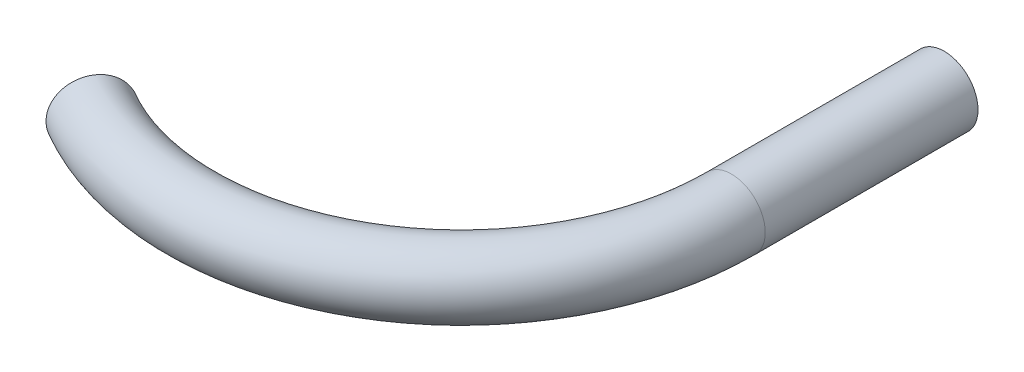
from build123d import *

# Parameters (mm, degrees)
SKETCH1_R           = 1.5875
SKETCH1_R_2         = 0.79375
REVOLVE1_ANGLE      = 120
SKETCH2_R           = 1.5875
SKETCH2_R_2         = 0.79375
BOSS_EXTRUDE1_DEPTH = 10


with BuildPart() as part:
    # Sketch1 → Revolve1 (revolve)
    with BuildSketch(Plane.XY):
        with Locations((12.7, 0)):
            Circle(SKETCH1_R)
        with Locations((12.7, 0)):
            Circle(SKETCH1_R_2, mode=Mode.SUBTRACT)
    revolve(axis=Axis((0, 67.148637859, 0), (0, -1, 0)), revolution_arc=REVOLVE1_ANGLE)

    # Sketch2 → Boss-Extrude1 (add)
    with BuildSketch(Plane(origin=(0, 0, 0), x_dir=(-1, 0, 0), z_dir=(0, 0, -1))):
        with Locations(Location((-12.7, 0, 0), (0, 0, 180))):
            Circle(SKETCH2_R)
        with Locations(Location((-12.7, 0, 0), (0, 0, 180))):
            Circle(SKETCH2_R_2, mode=Mode.SUBTRACT)
    extrude(amount=BOSS_EXTRUDE1_DEPTH)


solid = part.part
